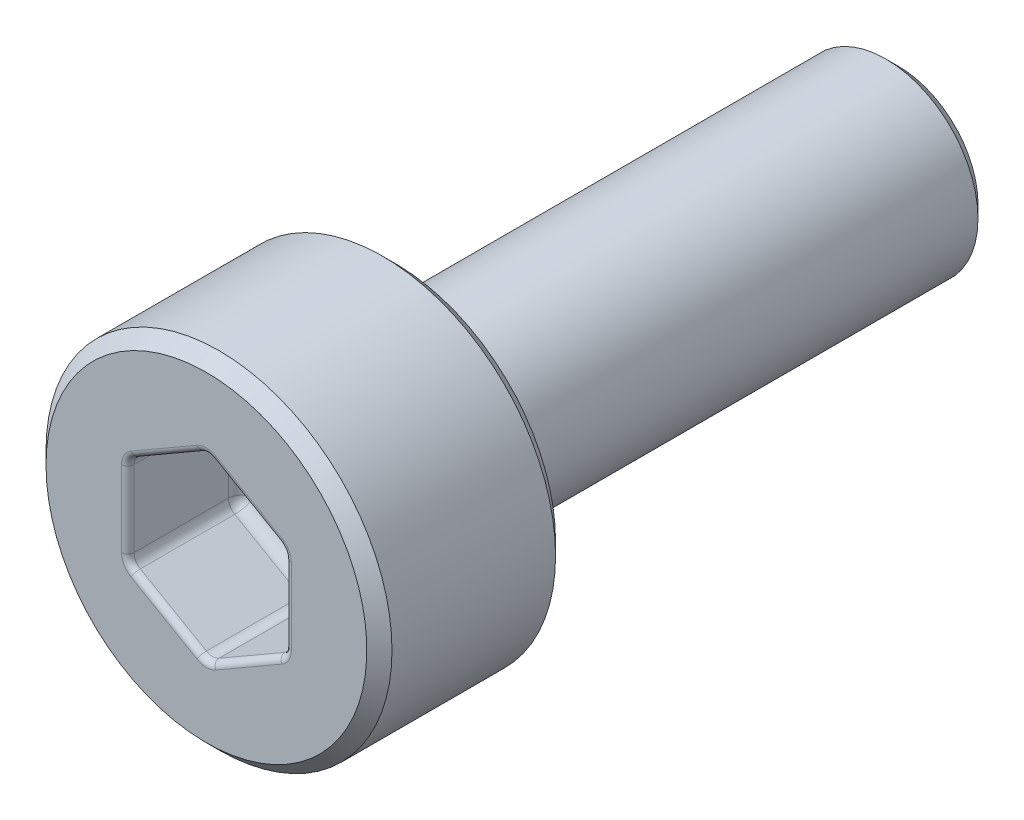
ISO-10303-21;
HEADER;
FILE_DESCRIPTION(('STEP AP214'),'2;1');
FILE_NAME('part.step','',(''),(''),'','','');
FILE_SCHEMA(('AUTOMOTIVE_DESIGN { 1 0 10303 214 1 1 1 1 }'));
ENDSEC;
DATA;
#1=APPLICATION_CONTEXT('core data for automotive mechanical design processes');
#2=APPLICATION_PROTOCOL_DEFINITION('international standard','automotive_design',2000,#1);
#3=PRODUCT_CONTEXT('',#1,'mechanical');
#4=PRODUCT('Part','Part','',(#3));
#5=PRODUCT_RELATED_PRODUCT_CATEGORY('part','',(#4));
#6=PRODUCT_DEFINITION_FORMATION('','',#4);
#7=PRODUCT_DEFINITION_CONTEXT('part definition',#1,'design');
#8=PRODUCT_DEFINITION('design','',#6,#7);
#9=PRODUCT_DEFINITION_SHAPE('','',#8);
#10=(LENGTH_UNIT() NAMED_UNIT(*) SI_UNIT(.MILLI.,.METRE.));
#11=(NAMED_UNIT(*) PLANE_ANGLE_UNIT() SI_UNIT($,.RADIAN.));
#12=(NAMED_UNIT(*) SI_UNIT($,.STERADIAN.) SOLID_ANGLE_UNIT());
#13=UNCERTAINTY_MEASURE_WITH_UNIT(LENGTH_MEASURE(1.E-05),#10,'distance_accuracy_value','');
#14=(GEOMETRIC_REPRESENTATION_CONTEXT(3) GLOBAL_UNCERTAINTY_ASSIGNED_CONTEXT((#13)) GLOBAL_UNIT_ASSIGNED_CONTEXT((#10,
#11,#12)) REPRESENTATION_CONTEXT('',''));
#15=CARTESIAN_POINT('',(0.,0.,0.));
#16=DIRECTION('',(0.,0.,1.));
#17=DIRECTION('',(1.,0.,0.));
#18=AXIS2_PLACEMENT_3D('',#15,#16,#17);
#19=CARTESIAN_POINT('',(0.,0.,3.));
#20=DIRECTION('',(0.,0.,-1.));
#21=DIRECTION('',(-1.,0.,0.));
#22=AXIS2_PLACEMENT_3D('',#19,#20,#21);
#23=PLANE('',#22);
#24=DIRECTION('',(0.,1.,0.));
#25=VECTOR('',#24,1.);
#26=CARTESIAN_POINT('',(1.35,0.,3.));
#27=LINE('',#26,#25);
#28=CARTESIAN_POINT('',(1.35,0.606217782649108,3.));
#29=VERTEX_POINT('',#28);
#30=CARTESIAN_POINT('',(1.35,-0.606217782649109,3.));
#31=VERTEX_POINT('',#30);
#32=EDGE_CURVE('E264',#29,#31,#27,.F.);
#33=ORIENTED_EDGE('',*,*,#32,.T.);
#34=CARTESIAN_POINT('',(1.05,-0.606217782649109,3.));
#35=DIRECTION('',(0.,0.,-1.));
#36=DIRECTION('',(-1.,0.,0.));
#37=AXIS2_PLACEMENT_3D('',#34,#35,#36);
#38=CIRCLE('',#37,0.3);
#39=CARTESIAN_POINT('',(1.2,-0.866025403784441,3.));
#40=VERTEX_POINT('',#39);
#41=EDGE_CURVE('E329',#31,#40,#38,.T.);
#42=ORIENTED_EDGE('',*,*,#41,.T.);
#43=DIRECTION('',(0.866025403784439,0.499999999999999,0.));
#44=VECTOR('',#43,1.);
#45=CARTESIAN_POINT('',(0.675,-1.16913429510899,3.));
#46=LINE('',#45,#44);
#47=CARTESIAN_POINT('',(0.15,-1.47224318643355,3.));
#48=VERTEX_POINT('',#47);
#49=EDGE_CURVE('E327',#40,#48,#46,.F.);
#50=ORIENTED_EDGE('',*,*,#49,.T.);
#51=CARTESIAN_POINT('',(0.,-1.21243556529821,3.));
#52=DIRECTION('',(0.,0.,-1.));
#53=DIRECTION('',(-1.,0.,0.));
#54=AXIS2_PLACEMENT_3D('',#51,#52,#53);
#55=CIRCLE('',#54,0.3);
#56=CARTESIAN_POINT('',(-0.15,-1.47224318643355,3.));
#57=VERTEX_POINT('',#56);
#58=EDGE_CURVE('E325',#48,#57,#55,.T.);
#59=ORIENTED_EDGE('',*,*,#58,.T.);
#60=DIRECTION('',(0.866025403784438,-0.500000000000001,0.));
#61=VECTOR('',#60,1.);
#62=CARTESIAN_POINT('',(-0.675000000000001,-1.16913429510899,3.));
#63=LINE('',#62,#61);
#64=CARTESIAN_POINT('',(-1.2,-0.866025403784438,3.));
#65=VERTEX_POINT('',#64);
#66=EDGE_CURVE('E323',#57,#65,#63,.F.);
#67=ORIENTED_EDGE('',*,*,#66,.T.);
#68=CARTESIAN_POINT('',(-1.05,-0.606217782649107,3.));
#69=DIRECTION('',(0.,0.,-1.));
#70=DIRECTION('',(-1.,0.,0.));
#71=AXIS2_PLACEMENT_3D('',#68,#69,#70);
#72=CIRCLE('',#71,0.3);
#73=CARTESIAN_POINT('',(-1.35,-0.606217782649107,3.));
#74=VERTEX_POINT('',#73);
#75=EDGE_CURVE('E321',#65,#74,#72,.T.);
#76=ORIENTED_EDGE('',*,*,#75,.T.);
#77=DIRECTION('',(0.,-1.,0.));
#78=VECTOR('',#77,1.);
#79=CARTESIAN_POINT('',(-1.35,0.,3.));
#80=LINE('',#79,#78);
#81=CARTESIAN_POINT('',(-1.35,0.606217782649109,3.));
#82=VERTEX_POINT('',#81);
#83=EDGE_CURVE('E319',#74,#82,#80,.F.);
#84=ORIENTED_EDGE('',*,*,#83,.T.);
#85=CARTESIAN_POINT('',(-1.05,0.606217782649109,3.));
#86=DIRECTION('',(0.,0.,-1.));
#87=DIRECTION('',(-1.,0.,0.));
#88=AXIS2_PLACEMENT_3D('',#85,#86,#87);
#89=CIRCLE('',#88,0.3);
#90=CARTESIAN_POINT('',(-1.2,0.86602540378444,3.));
#91=VERTEX_POINT('',#90);
#92=EDGE_CURVE('E317',#82,#91,#89,.T.);
#93=ORIENTED_EDGE('',*,*,#92,.T.);
#94=DIRECTION('',(-0.866025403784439,-0.5,0.));
#95=VECTOR('',#94,1.);
#96=CARTESIAN_POINT('',(-0.675,1.16913429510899,3.));
#97=LINE('',#96,#95);
#98=CARTESIAN_POINT('',(-0.149999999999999,1.47224318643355,3.));
#99=VERTEX_POINT('',#98);
#100=EDGE_CURVE('E315',#91,#99,#97,.F.);
#101=ORIENTED_EDGE('',*,*,#100,.T.);
#102=CARTESIAN_POINT('',(0.,1.21243556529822,3.));
#103=DIRECTION('',(0.,0.,-1.));
#104=DIRECTION('',(-1.,0.,0.));
#105=AXIS2_PLACEMENT_3D('',#102,#103,#104);
#106=CIRCLE('',#105,0.3);
#107=CARTESIAN_POINT('',(0.150000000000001,1.47224318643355,3.));
#108=VERTEX_POINT('',#107);
#109=EDGE_CURVE('E313',#99,#108,#106,.T.);
#110=ORIENTED_EDGE('',*,*,#109,.T.);
#111=DIRECTION('',(-0.866025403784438,0.5,0.));
#112=VECTOR('',#111,1.);
#113=CARTESIAN_POINT('',(0.675000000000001,1.16913429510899,3.));
#114=LINE('',#113,#112);
#115=CARTESIAN_POINT('',(1.2,0.86602540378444,3.));
#116=VERTEX_POINT('',#115);
#117=EDGE_CURVE('E311',#108,#116,#114,.F.);
#118=ORIENTED_EDGE('',*,*,#117,.T.);
#119=CARTESIAN_POINT('',(1.05,0.606217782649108,3.));
#120=DIRECTION('',(0.,0.,-1.));
#121=DIRECTION('',(-1.,0.,0.));
#122=AXIS2_PLACEMENT_3D('',#119,#120,#121);
#123=CIRCLE('',#122,0.3);
#124=EDGE_CURVE('E309',#116,#29,#123,.T.);
#125=ORIENTED_EDGE('',*,*,#124,.T.);
#126=EDGE_LOOP('',(#33,#42,#50,#59,#67,#76,#84,#93,#101,#110,#118,#125));
#127=FACE_BOUND('',#126,.T.);
#128=CARTESIAN_POINT('',(0.,0.,3.));
#129=DIRECTION('',(0.,0.,-1.));
#130=DIRECTION('',(-1.,0.,0.));
#131=AXIS2_PLACEMENT_3D('',#128,#129,#130);
#132=CIRCLE('',#131,2.55);
#133=CARTESIAN_POINT('',(-2.55,0.,3.));
#134=VERTEX_POINT('',#133);
#135=EDGE_CURVE('E307',#134,#134,#132,.F.);
#136=ORIENTED_EDGE('',*,*,#135,.T.);
#137=EDGE_LOOP('',(#136));
#138=FACE_BOUND('',#137,.T.);
#139=ADVANCED_FACE('F35',(#127,#138),#23,.F.);
#140=CARTESIAN_POINT('',(0.,0.,21.9198795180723));
#141=DIRECTION('',(0.,0.,1.));
#142=DIRECTION('',(1.,0.,0.));
#143=AXIS2_PLACEMENT_3D('',#140,#141,#142);
#144=CYLINDRICAL_SURFACE('',#143,2.75);
#145=CARTESIAN_POINT('',(0.,0.,2.8));
#146=DIRECTION('',(0.,0.,-1.));
#147=DIRECTION('',(-1.,0.,0.));
#148=AXIS2_PLACEMENT_3D('',#145,#146,#147);
#149=CIRCLE('',#148,2.75);
#150=CARTESIAN_POINT('',(-2.75,0.,2.8));
#151=VERTEX_POINT('',#150);
#152=EDGE_CURVE('E869',#151,#151,#149,.T.);
#153=ORIENTED_EDGE('',*,*,#152,.T.);
#154=EDGE_LOOP('',(#153));
#155=FACE_BOUND('',#154,.T.);
#156=CARTESIAN_POINT('',(0.,0.,0.199999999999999));
#157=DIRECTION('',(0.,0.,1.));
#158=DIRECTION('',(1.,0.,0.));
#159=AXIS2_PLACEMENT_3D('',#156,#157,#158);
#160=CIRCLE('',#159,2.75);
#161=CARTESIAN_POINT('',(2.75,0.,0.199999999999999));
#162=VERTEX_POINT('',#161);
#163=EDGE_CURVE('E874',#162,#162,#160,.T.);
#164=ORIENTED_EDGE('',*,*,#163,.T.);
#165=EDGE_LOOP('',(#164));
#166=FACE_BOUND('',#165,.T.);
#167=ADVANCED_FACE('F428',(#155,#166),#144,.T.);
#168=CARTESIAN_POINT('',(0.,2.75,0.));
#169=DIRECTION('',(0.,0.,1.));
#170=DIRECTION('',(1.,0.,0.));
#171=AXIS2_PLACEMENT_3D('',#168,#169,#170);
#172=PLANE('',#171);
#173=CARTESIAN_POINT('',(0.,0.,0.));
#174=DIRECTION('',(0.,0.,1.));
#175=DIRECTION('',(1.,0.,0.));
#176=AXIS2_PLACEMENT_3D('',#173,#174,#175);
#177=CIRCLE('',#176,1.665);
#178=CARTESIAN_POINT('',(1.665,0.,0.));
#179=VERTEX_POINT('',#178);
#180=EDGE_CURVE('E259',#179,#179,#177,.T.);
#181=ORIENTED_EDGE('',*,*,#180,.T.);
#182=EDGE_LOOP('',(#181));
#183=FACE_BOUND('',#182,.T.);
#184=CARTESIAN_POINT('',(0.,0.,0.));
#185=DIRECTION('',(0.,0.,1.));
#186=DIRECTION('',(1.,0.,0.));
#187=AXIS2_PLACEMENT_3D('',#184,#185,#186);
#188=CIRCLE('',#187,2.55);
#189=CARTESIAN_POINT('',(2.55,0.,0.));
#190=VERTEX_POINT('',#189);
#191=EDGE_CURVE('E867',#190,#190,#188,.F.);
#192=ORIENTED_EDGE('',*,*,#191,.T.);
#193=EDGE_LOOP('',(#192));
#194=FACE_BOUND('',#193,.T.);
#195=ADVANCED_FACE('F434',(#183,#194),#172,.F.);
#196=CARTESIAN_POINT('',(0.,0.,21.9198795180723));
#197=DIRECTION('',(0.,0.,1.));
#198=DIRECTION('',(1.,0.,0.));
#199=AXIS2_PLACEMENT_3D('',#196,#197,#198);
#200=CYLINDRICAL_SURFACE('',#199,1.465);
#201=CARTESIAN_POINT('',(0.,0.,-0.200000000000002));
#202=DIRECTION('',(0.,0.,1.));
#203=DIRECTION('',(1.,0.,0.));
#204=AXIS2_PLACEMENT_3D('',#201,#202,#203);
#205=CIRCLE('',#204,1.465);
#206=CARTESIAN_POINT('',(1.465,0.,-0.200000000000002));
#207=VERTEX_POINT('',#206);
#208=EDGE_CURVE('E262',#207,#207,#205,.F.);
#209=ORIENTED_EDGE('',*,*,#208,.T.);
#210=EDGE_LOOP('',(#209));
#211=FACE_BOUND('',#210,.T.);
#212=CARTESIAN_POINT('',(0.,0.,-7.79999999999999));
#213=DIRECTION('',(0.,0.,1.));
#214=DIRECTION('',(1.,0.,0.));
#215=AXIS2_PLACEMENT_3D('',#212,#213,#214);
#216=CIRCLE('',#215,1.465);
#217=CARTESIAN_POINT('',(1.465,0.,-7.79999999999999));
#218=VERTEX_POINT('',#217);
#219=EDGE_CURVE('E868',#218,#218,#216,.T.);
#220=ORIENTED_EDGE('',*,*,#219,.T.);
#221=EDGE_LOOP('',(#220));
#222=FACE_BOUND('',#221,.T.);
#223=ADVANCED_FACE('F809',(#211,#222),#200,.T.);
#224=CARTESIAN_POINT('',(0.,1.465,-8.));
#225=DIRECTION('',(0.,0.,1.));
#226=DIRECTION('',(1.,0.,0.));
#227=AXIS2_PLACEMENT_3D('',#224,#225,#226);
#228=PLANE('',#227);
#229=CARTESIAN_POINT('',(0.,0.,-8.));
#230=DIRECTION('',(0.,0.,1.));
#231=DIRECTION('',(1.,0.,0.));
#232=AXIS2_PLACEMENT_3D('',#229,#230,#231);
#233=CIRCLE('',#232,1.26499999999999);
#234=CARTESIAN_POINT('',(1.26499999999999,0.,-8.));
#235=VERTEX_POINT('',#234);
#236=EDGE_CURVE('E209',#235,#235,#233,.F.);
#237=ORIENTED_EDGE('',*,*,#236,.T.);
#238=EDGE_LOOP('',(#237));
#239=FACE_BOUND('',#238,.T.);
#240=ADVANCED_FACE('F801',(#239),#228,.F.);
#241=CARTESIAN_POINT('',(0.,-1.44337567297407,1.2));
#242=DIRECTION('',(0.499999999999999,-0.866025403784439,0.));
#243=DIRECTION('',(0.866025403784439,0.499999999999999,0.));
#244=AXIS2_PLACEMENT_3D('',#241,#242,#243);
#245=PLANE('',#244);
#246=DIRECTION('',(0.,0.,1.));
#247=VECTOR('',#246,1.);
#248=CARTESIAN_POINT('',(0.0999999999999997,-1.3856406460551,3.));
#249=LINE('',#248,#247);
#250=CARTESIAN_POINT('',(0.0999999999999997,-1.3856406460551,1.4));
#251=VERTEX_POINT('',#250);
#252=CARTESIAN_POINT('',(0.0999999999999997,-1.3856406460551,2.9));
#253=VERTEX_POINT('',#252);
#254=EDGE_CURVE('E256',#251,#253,#249,.T.);
#255=ORIENTED_EDGE('',*,*,#254,.T.);
#256=DIRECTION('',(0.866025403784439,0.499999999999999,0.));
#257=VECTOR('',#256,1.);
#258=CARTESIAN_POINT('',(0.,-1.44337567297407,2.9));
#259=LINE('',#258,#257);
#260=CARTESIAN_POINT('',(1.15,-0.779422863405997,2.9));
#261=VERTEX_POINT('',#260);
#262=EDGE_CURVE('E335',#253,#261,#259,.T.);
#263=ORIENTED_EDGE('',*,*,#262,.T.);
#264=DIRECTION('',(0.,0.,1.));
#265=VECTOR('',#264,1.);
#266=CARTESIAN_POINT('',(1.15,-0.779422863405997,1.2));
#267=LINE('',#266,#265);
#268=CARTESIAN_POINT('',(1.15,-0.779422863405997,1.4));
#269=VERTEX_POINT('',#268);
#270=EDGE_CURVE('E252',#261,#269,#267,.F.);
#271=ORIENTED_EDGE('',*,*,#270,.T.);
#272=DIRECTION('',(0.866025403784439,0.499999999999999,0.));
#273=VECTOR('',#272,1.);
#274=CARTESIAN_POINT('',(0.,-1.44337567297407,1.4));
#275=LINE('',#274,#273);
#276=EDGE_CURVE('E254',#269,#251,#275,.F.);
#277=ORIENTED_EDGE('',*,*,#276,.T.);
#278=EDGE_LOOP('',(#255,#263,#271,#277));
#279=FACE_BOUND('',#278,.T.);
#280=ADVANCED_FACE('F792',(#279),#245,.F.);
#281=CARTESIAN_POINT('',(-1.25,-0.721687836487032,1.2));
#282=DIRECTION('',(-0.5,-0.866025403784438,0.));
#283=DIRECTION('',(0.866025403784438,-0.500000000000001,0.));
#284=AXIS2_PLACEMENT_3D('',#281,#282,#283);
#285=PLANE('',#284);
#286=DIRECTION('',(0.,0.,1.));
#287=VECTOR('',#286,1.);
#288=CARTESIAN_POINT('',(-1.15,-0.779422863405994,3.));
#289=LINE('',#288,#287);
#290=CARTESIAN_POINT('',(-1.15,-0.779422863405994,1.4));
#291=VERTEX_POINT('',#290);
#292=CARTESIAN_POINT('',(-1.15,-0.779422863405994,2.9));
#293=VERTEX_POINT('',#292);
#294=EDGE_CURVE('E223',#291,#293,#289,.T.);
#295=ORIENTED_EDGE('',*,*,#294,.T.);
#296=DIRECTION('',(0.866025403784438,-0.500000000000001,0.));
#297=VECTOR('',#296,1.);
#298=CARTESIAN_POINT('',(-1.25,-0.721687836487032,2.9));
#299=LINE('',#298,#297);
#300=CARTESIAN_POINT('',(-0.1,-1.3856406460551,2.9));
#301=VERTEX_POINT('',#300);
#302=EDGE_CURVE('E339',#293,#301,#299,.T.);
#303=ORIENTED_EDGE('',*,*,#302,.T.);
#304=DIRECTION('',(0.,0.,1.));
#305=VECTOR('',#304,1.);
#306=CARTESIAN_POINT('',(-0.1,-1.3856406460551,1.2));
#307=LINE('',#306,#305);
#308=CARTESIAN_POINT('',(-0.1,-1.3856406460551,1.4));
#309=VERTEX_POINT('',#308);
#310=EDGE_CURVE('E215',#301,#309,#307,.F.);
#311=ORIENTED_EDGE('',*,*,#310,.T.);
#312=DIRECTION('',(0.866025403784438,-0.500000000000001,0.));
#313=VECTOR('',#312,1.);
#314=CARTESIAN_POINT('',(-1.25,-0.721687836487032,1.4));
#315=LINE('',#314,#313);
#316=EDGE_CURVE('E186',#309,#291,#315,.F.);
#317=ORIENTED_EDGE('',*,*,#316,.T.);
#318=EDGE_LOOP('',(#295,#303,#311,#317));
#319=FACE_BOUND('',#318,.T.);
#320=ADVANCED_FACE('F784',(#319),#285,.F.);
#321=CARTESIAN_POINT('',(-1.25,0.721687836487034,1.2));
#322=DIRECTION('',(-1.,0.,0.));
#323=DIRECTION('',(0.,-1.,0.));
#324=AXIS2_PLACEMENT_3D('',#321,#322,#323);
#325=PLANE('',#324);
#326=DIRECTION('',(0.,0.,1.));
#327=VECTOR('',#326,1.);
#328=CARTESIAN_POINT('',(-1.25,0.606217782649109,3.));
#329=LINE('',#328,#327);
#330=CARTESIAN_POINT('',(-1.25,0.606217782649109,1.4));
#331=VERTEX_POINT('',#330);
#332=CARTESIAN_POINT('',(-1.25,0.606217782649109,2.9));
#333=VERTEX_POINT('',#332);
#334=EDGE_CURVE('E226',#331,#333,#329,.T.);
#335=ORIENTED_EDGE('',*,*,#334,.T.);
#336=DIRECTION('',(0.,-1.,0.));
#337=VECTOR('',#336,1.);
#338=CARTESIAN_POINT('',(-1.25,0.721687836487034,2.9));
#339=LINE('',#338,#337);
#340=CARTESIAN_POINT('',(-1.25,-0.606217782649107,2.9));
#341=VERTEX_POINT('',#340);
#342=EDGE_CURVE('E343',#333,#341,#339,.T.);
#343=ORIENTED_EDGE('',*,*,#342,.T.);
#344=DIRECTION('',(0.,0.,1.));
#345=VECTOR('',#344,1.);
#346=CARTESIAN_POINT('',(-1.25,-0.606217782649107,1.2));
#347=LINE('',#346,#345);
#348=CARTESIAN_POINT('',(-1.25,-0.606217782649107,1.4));
#349=VERTEX_POINT('',#348);
#350=EDGE_CURVE('E231',#341,#349,#347,.F.);
#351=ORIENTED_EDGE('',*,*,#350,.T.);
#352=DIRECTION('',(0.,-1.,0.));
#353=VECTOR('',#352,1.);
#354=CARTESIAN_POINT('',(-1.25,0.721687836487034,1.4));
#355=LINE('',#354,#353);
#356=EDGE_CURVE('E229',#349,#331,#355,.F.);
#357=ORIENTED_EDGE('',*,*,#356,.T.);
#358=EDGE_LOOP('',(#335,#343,#351,#357));
#359=FACE_BOUND('',#358,.T.);
#360=ADVANCED_FACE('F403',(#359),#325,.F.);
#361=CARTESIAN_POINT('',(0.,1.44337567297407,1.2));
#362=DIRECTION('',(-0.5,0.866025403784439,0.));
#363=DIRECTION('',(-0.866025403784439,-0.5,0.));
#364=AXIS2_PLACEMENT_3D('',#361,#362,#363);
#365=PLANE('',#364);
#366=DIRECTION('',(0.,0.,1.));
#367=VECTOR('',#366,1.);
#368=CARTESIAN_POINT('',(-0.0999999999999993,1.3856406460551,3.));
#369=LINE('',#368,#367);
#370=CARTESIAN_POINT('',(-0.0999999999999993,1.3856406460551,1.4));
#371=VERTEX_POINT('',#370);
#372=CARTESIAN_POINT('',(-0.0999999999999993,1.3856406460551,2.9));
#373=VERTEX_POINT('',#372);
#374=EDGE_CURVE('E237',#371,#373,#369,.T.);
#375=ORIENTED_EDGE('',*,*,#374,.T.);
#376=DIRECTION('',(-0.866025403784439,-0.5,0.));
#377=VECTOR('',#376,1.);
#378=CARTESIAN_POINT('',(0.,1.44337567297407,2.9));
#379=LINE('',#378,#377);
#380=CARTESIAN_POINT('',(-1.15,0.779422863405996,2.9));
#381=VERTEX_POINT('',#380);
#382=EDGE_CURVE('E347',#373,#381,#379,.T.);
#383=ORIENTED_EDGE('',*,*,#382,.T.);
#384=DIRECTION('',(0.,0.,1.));
#385=VECTOR('',#384,1.);
#386=CARTESIAN_POINT('',(-1.15,0.779422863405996,1.2));
#387=LINE('',#386,#385);
#388=CARTESIAN_POINT('',(-1.15,0.779422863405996,1.4));
#389=VERTEX_POINT('',#388);
#390=EDGE_CURVE('E233',#381,#389,#387,.F.);
#391=ORIENTED_EDGE('',*,*,#390,.T.);
#392=DIRECTION('',(-0.866025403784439,-0.5,0.));
#393=VECTOR('',#392,1.);
#394=CARTESIAN_POINT('',(0.,1.44337567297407,1.4));
#395=LINE('',#394,#393);
#396=EDGE_CURVE('E235',#389,#371,#395,.F.);
#397=ORIENTED_EDGE('',*,*,#396,.T.);
#398=EDGE_LOOP('',(#375,#383,#391,#397));
#399=FACE_BOUND('',#398,.T.);
#400=ADVANCED_FACE('F767',(#399),#365,.F.);
#401=CARTESIAN_POINT('',(1.25,0.721687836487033,1.2));
#402=DIRECTION('',(0.5,0.866025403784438,0.));
#403=DIRECTION('',(-0.866025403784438,0.5,0.));
#404=AXIS2_PLACEMENT_3D('',#401,#402,#403);
#405=PLANE('',#404);
#406=DIRECTION('',(0.,0.,1.));
#407=VECTOR('',#406,1.);
#408=CARTESIAN_POINT('',(1.15,0.779422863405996,3.));
#409=LINE('',#408,#407);
#410=CARTESIAN_POINT('',(1.15,0.779422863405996,1.4));
#411=VERTEX_POINT('',#410);
#412=CARTESIAN_POINT('',(1.15,0.779422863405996,2.9));
#413=VERTEX_POINT('',#412);
#414=EDGE_CURVE('E244',#411,#413,#409,.T.);
#415=ORIENTED_EDGE('',*,*,#414,.T.);
#416=DIRECTION('',(-0.866025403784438,0.5,0.));
#417=VECTOR('',#416,1.);
#418=CARTESIAN_POINT('',(1.25,0.721687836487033,2.9));
#419=LINE('',#418,#417);
#420=CARTESIAN_POINT('',(0.100000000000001,1.3856406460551,2.9));
#421=VERTEX_POINT('',#420);
#422=EDGE_CURVE('E351',#413,#421,#419,.T.);
#423=ORIENTED_EDGE('',*,*,#422,.T.);
#424=DIRECTION('',(0.,0.,1.));
#425=VECTOR('',#424,1.);
#426=CARTESIAN_POINT('',(0.100000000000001,1.3856406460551,1.2));
#427=LINE('',#426,#425);
#428=CARTESIAN_POINT('',(0.100000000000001,1.3856406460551,1.4));
#429=VERTEX_POINT('',#428);
#430=EDGE_CURVE('E240',#421,#429,#427,.F.);
#431=ORIENTED_EDGE('',*,*,#430,.T.);
#432=DIRECTION('',(-0.866025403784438,0.5,0.));
#433=VECTOR('',#432,1.);
#434=CARTESIAN_POINT('',(1.25,0.721687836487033,1.4));
#435=LINE('',#434,#433);
#436=EDGE_CURVE('E242',#429,#411,#435,.F.);
#437=ORIENTED_EDGE('',*,*,#436,.T.);
#438=EDGE_LOOP('',(#415,#423,#431,#437));
#439=FACE_BOUND('',#438,.T.);
#440=ADVANCED_FACE('F759',(#439),#405,.F.);
#441=CARTESIAN_POINT('',(1.25,-0.721687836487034,1.2));
#442=DIRECTION('',(1.,0.,0.));
#443=DIRECTION('',(0.,1.,0.));
#444=AXIS2_PLACEMENT_3D('',#441,#442,#443);
#445=PLANE('',#444);
#446=DIRECTION('',(0.,0.,1.));
#447=VECTOR('',#446,1.);
#448=CARTESIAN_POINT('',(1.25,-0.606217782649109,3.));
#449=LINE('',#448,#447);
#450=CARTESIAN_POINT('',(1.25,-0.606217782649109,1.4));
#451=VERTEX_POINT('',#450);
#452=CARTESIAN_POINT('',(1.25,-0.606217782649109,2.9));
#453=VERTEX_POINT('',#452);
#454=EDGE_CURVE('E250',#451,#453,#449,.T.);
#455=ORIENTED_EDGE('',*,*,#454,.T.);
#456=DIRECTION('',(0.,1.,0.));
#457=VECTOR('',#456,1.);
#458=CARTESIAN_POINT('',(1.25,-0.721687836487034,2.9));
#459=LINE('',#458,#457);
#460=CARTESIAN_POINT('',(1.25,0.606217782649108,2.9));
#461=VERTEX_POINT('',#460);
#462=EDGE_CURVE('E11',#453,#461,#459,.T.);
#463=ORIENTED_EDGE('',*,*,#462,.T.);
#464=DIRECTION('',(0.,0.,1.));
#465=VECTOR('',#464,1.);
#466=CARTESIAN_POINT('',(1.25,0.606217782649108,1.2));
#467=LINE('',#466,#465);
#468=CARTESIAN_POINT('',(1.25,0.606217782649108,1.4));
#469=VERTEX_POINT('',#468);
#470=EDGE_CURVE('E246',#461,#469,#467,.F.);
#471=ORIENTED_EDGE('',*,*,#470,.T.);
#472=DIRECTION('',(0.,1.,0.));
#473=VECTOR('',#472,1.);
#474=CARTESIAN_POINT('',(1.25,-0.721687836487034,1.4));
#475=LINE('',#474,#473);
#476=EDGE_CURVE('E248',#469,#451,#475,.F.);
#477=ORIENTED_EDGE('',*,*,#476,.T.);
#478=EDGE_LOOP('',(#455,#463,#471,#477));
#479=FACE_BOUND('',#478,.T.);
#480=ADVANCED_FACE('F751',(#479),#445,.F.);
#481=CARTESIAN_POINT('',(0.,0.,1.2));
#482=DIRECTION('',(0.,0.,1.));
#483=DIRECTION('',(1.,0.,0.));
#484=AXIS2_PLACEMENT_3D('',#481,#482,#483);
#485=PLANE('',#484);
#486=DIRECTION('',(0.,-1.,0.));
#487=VECTOR('',#486,1.);
#488=CARTESIAN_POINT('',(-1.05,0.,1.2));
#489=LINE('',#488,#487);
#490=CARTESIAN_POINT('',(-1.05,0.606217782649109,1.2));
#491=VERTEX_POINT('',#490);
#492=CARTESIAN_POINT('',(-1.05,-0.606217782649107,1.2));
#493=VERTEX_POINT('',#492);
#494=EDGE_CURVE('E213',#491,#493,#489,.T.);
#495=ORIENTED_EDGE('',*,*,#494,.T.);
#496=DIRECTION('',(0.866025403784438,-0.500000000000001,0.));
#497=VECTOR('',#496,1.);
#498=CARTESIAN_POINT('',(-0.525000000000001,-0.909326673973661,1.2));
#499=LINE('',#498,#497);
#500=CARTESIAN_POINT('',(0.,-1.21243556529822,1.2));
#501=VERTEX_POINT('',#500);
#502=EDGE_CURVE('E184',#493,#501,#499,.T.);
#503=ORIENTED_EDGE('',*,*,#502,.T.);
#504=DIRECTION('',(0.866025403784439,0.499999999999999,0.));
#505=VECTOR('',#504,1.);
#506=CARTESIAN_POINT('',(0.525,-0.909326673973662,1.2));
#507=LINE('',#506,#505);
#508=CARTESIAN_POINT('',(1.05,-0.606217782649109,1.2));
#509=VERTEX_POINT('',#508);
#510=EDGE_CURVE('E202',#501,#509,#507,.T.);
#511=ORIENTED_EDGE('',*,*,#510,.T.);
#512=DIRECTION('',(0.,1.,0.));
#513=VECTOR('',#512,1.);
#514=CARTESIAN_POINT('',(1.05,0.,1.2));
#515=LINE('',#514,#513);
#516=CARTESIAN_POINT('',(1.05,0.606217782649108,1.2));
#517=VERTEX_POINT('',#516);
#518=EDGE_CURVE('E208',#509,#517,#515,.T.);
#519=ORIENTED_EDGE('',*,*,#518,.T.);
#520=DIRECTION('',(-0.866025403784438,0.5,0.));
#521=VECTOR('',#520,1.);
#522=CARTESIAN_POINT('',(0.525000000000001,0.909326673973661,1.2));
#523=LINE('',#522,#521);
#524=CARTESIAN_POINT('',(0.,1.21243556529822,1.2));
#525=VERTEX_POINT('',#524);
#526=EDGE_CURVE('E881',#517,#525,#523,.T.);
#527=ORIENTED_EDGE('',*,*,#526,.T.);
#528=DIRECTION('',(-0.866025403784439,-0.5,0.));
#529=VECTOR('',#528,1.);
#530=CARTESIAN_POINT('',(-0.525,0.909326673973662,1.2));
#531=LINE('',#530,#529);
#532=EDGE_CURVE('E218',#525,#491,#531,.T.);
#533=ORIENTED_EDGE('',*,*,#532,.T.);
#534=EDGE_LOOP('',(#495,#503,#511,#519,#527,#533));
#535=FACE_BOUND('',#534,.T.);
#536=ADVANCED_FACE('F211',(#535),#485,.T.);
#537=CARTESIAN_POINT('',(0.,0.,3.));
#538=DIRECTION('',(0.,0.,-1.));
#539=DIRECTION('',(-1.,0.,0.));
#540=AXIS2_PLACEMENT_3D('',#537,#538,#539);
#541=CONICAL_SURFACE('',#540,2.55,0.785398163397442);
#542=ORIENTED_EDGE('',*,*,#152,.F.);
#543=EDGE_LOOP('',(#542));
#544=FACE_BOUND('',#543,.T.);
#545=ORIENTED_EDGE('',*,*,#135,.F.);
#546=EDGE_LOOP('',(#545));
#547=FACE_BOUND('',#546,.T.);
#548=ADVANCED_FACE('F440',(#544,#547),#541,.T.);
#549=CARTESIAN_POINT('',(0.,0.,0.199999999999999));
#550=DIRECTION('',(0.,0.,1.));
#551=DIRECTION('',(1.,0.,0.));
#552=AXIS2_PLACEMENT_3D('',#549,#550,#551);
#553=CONICAL_SURFACE('',#552,2.75,0.785398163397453);
#554=ORIENTED_EDGE('',*,*,#191,.F.);
#555=EDGE_LOOP('',(#554));
#556=FACE_BOUND('',#555,.T.);
#557=ORIENTED_EDGE('',*,*,#163,.F.);
#558=EDGE_LOOP('',(#557));
#559=FACE_BOUND('',#558,.T.);
#560=ADVANCED_FACE('F443',(#556,#559),#553,.T.);
#561=CARTESIAN_POINT('',(0.,0.,-7.79999999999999));
#562=DIRECTION('',(0.,0.,1.));
#563=DIRECTION('',(1.,0.,0.));
#564=AXIS2_PLACEMENT_3D('',#561,#562,#563);
#565=CONICAL_SURFACE('',#564,1.465,0.78539816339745);
#566=ORIENTED_EDGE('',*,*,#236,.F.);
#567=EDGE_LOOP('',(#566));
#568=FACE_BOUND('',#567,.T.);
#569=ORIENTED_EDGE('',*,*,#219,.F.);
#570=EDGE_LOOP('',(#569));
#571=FACE_BOUND('',#570,.T.);
#572=ADVANCED_FACE('F447',(#568,#571),#565,.T.);
#573=CARTESIAN_POINT('',(0.,1.21243556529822,1.2));
#574=DIRECTION('',(0.,0.,-1.));
#575=DIRECTION('',(-1.,0.,0.));
#576=AXIS2_PLACEMENT_3D('',#573,#574,#575);
#577=CYLINDRICAL_SURFACE('',#576,0.2);
#578=ORIENTED_EDGE('',*,*,#430,.F.);
#579=CARTESIAN_POINT('',(0.,1.21243556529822,2.9));
#580=DIRECTION('',(0.,0.,-1.));
#581=DIRECTION('',(-1.,0.,0.));
#582=AXIS2_PLACEMENT_3D('',#579,#580,#581);
#583=CIRCLE('',#582,0.2);
#584=EDGE_CURVE('E349',#421,#373,#583,.F.);
#585=ORIENTED_EDGE('',*,*,#584,.T.);
#586=ORIENTED_EDGE('',*,*,#374,.F.);
#587=CARTESIAN_POINT('',(0.,1.21243556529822,1.4));
#588=DIRECTION('',(0.,0.,1.));
#589=DIRECTION('',(1.,0.,0.));
#590=AXIS2_PLACEMENT_3D('',#587,#588,#589);
#591=CIRCLE('',#590,0.2);
#592=EDGE_CURVE('E304',#429,#371,#591,.T.);
#593=ORIENTED_EDGE('',*,*,#592,.F.);
#594=EDGE_LOOP('',(#578,#585,#586,#593));
#595=FACE_BOUND('',#594,.T.);
#596=ADVANCED_FACE('F451',(#595),#577,.F.);
#597=CARTESIAN_POINT('',(0.525000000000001,0.909326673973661,1.4));
#598=DIRECTION('',(-0.866025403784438,0.5,0.));
#599=DIRECTION('',(-0.5,-0.866025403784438,0.));
#600=AXIS2_PLACEMENT_3D('',#597,#598,#599);
#601=CYLINDRICAL_SURFACE('',#600,0.2);
#602=CARTESIAN_POINT('',(1.05,0.606217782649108,1.4));
#603=DIRECTION('',(-0.866025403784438,0.5,0.));
#604=DIRECTION('',(-0.5,-0.866025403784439,0.));
#605=AXIS2_PLACEMENT_3D('',#602,#603,#604);
#606=CIRCLE('',#605,0.2);
#607=EDGE_CURVE('E298',#411,#517,#606,.T.);
#608=ORIENTED_EDGE('',*,*,#607,.F.);
#609=ORIENTED_EDGE('',*,*,#436,.F.);
#610=CARTESIAN_POINT('',(0.,1.21243556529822,1.4));
#611=DIRECTION('',(0.866025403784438,-0.500000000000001,0.));
#612=DIRECTION('',(0.500000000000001,0.866025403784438,0.));
#613=AXIS2_PLACEMENT_3D('',#610,#611,#612);
#614=CIRCLE('',#613,0.2);
#615=EDGE_CURVE('E301',#525,#429,#614,.T.);
#616=ORIENTED_EDGE('',*,*,#615,.F.);
#617=ORIENTED_EDGE('',*,*,#526,.F.);
#618=EDGE_LOOP('',(#608,#609,#616,#617));
#619=FACE_BOUND('',#618,.T.);
#620=ADVANCED_FACE('F712',(#619),#601,.F.);
#621=CARTESIAN_POINT('',(1.05,0.606217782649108,1.2));
#622=DIRECTION('',(0.,0.,-1.));
#623=DIRECTION('',(-1.,0.,0.));
#624=AXIS2_PLACEMENT_3D('',#621,#622,#623);
#625=CYLINDRICAL_SURFACE('',#624,0.2);
#626=ORIENTED_EDGE('',*,*,#470,.F.);
#627=CARTESIAN_POINT('',(1.05,0.606217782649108,2.9));
#628=DIRECTION('',(0.,0.,-1.));
#629=DIRECTION('',(-1.,0.,0.));
#630=AXIS2_PLACEMENT_3D('',#627,#628,#629);
#631=CIRCLE('',#630,0.2);
#632=EDGE_CURVE('E44',#461,#413,#631,.F.);
#633=ORIENTED_EDGE('',*,*,#632,.T.);
#634=ORIENTED_EDGE('',*,*,#414,.F.);
#635=CARTESIAN_POINT('',(1.05,0.606217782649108,1.4));
#636=DIRECTION('',(0.,0.,1.));
#637=DIRECTION('',(1.,0.,0.));
#638=AXIS2_PLACEMENT_3D('',#635,#636,#637);
#639=CIRCLE('',#638,0.2);
#640=EDGE_CURVE('E295',#469,#411,#639,.T.);
#641=ORIENTED_EDGE('',*,*,#640,.F.);
#642=EDGE_LOOP('',(#626,#633,#634,#641));
#643=FACE_BOUND('',#642,.T.);
#644=ADVANCED_FACE('F703',(#643),#625,.F.);
#645=CARTESIAN_POINT('',(0.,1.21243556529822,1.4));
#646=DIRECTION('',(0.,0.,1.));
#647=DIRECTION('',(1.,0.,0.));
#648=AXIS2_PLACEMENT_3D('',#645,#646,#647);
#649=SPHERICAL_SURFACE('',#648,0.2);
#650=ORIENTED_EDGE('',*,*,#615,.T.);
#651=ORIENTED_EDGE('',*,*,#592,.T.);
#652=CARTESIAN_POINT('',(0.,1.21243556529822,1.4));
#653=DIRECTION('',(-0.866025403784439,-0.5,0.));
#654=DIRECTION('',(0.5,-0.866025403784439,0.));
#655=AXIS2_PLACEMENT_3D('',#652,#653,#654);
#656=CIRCLE('',#655,0.2);
#657=EDGE_CURVE('E292',#525,#371,#656,.F.);
#658=ORIENTED_EDGE('',*,*,#657,.F.);
#659=EDGE_LOOP('',(#650,#651,#658));
#660=FACE_BOUND('',#659,.T.);
#661=ADVANCED_FACE('F694',(#660),#649,.F.);
#662=CARTESIAN_POINT('',(1.05,0.606217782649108,1.4));
#663=DIRECTION('',(0.,0.,1.));
#664=DIRECTION('',(1.,0.,0.));
#665=AXIS2_PLACEMENT_3D('',#662,#663,#664);
#666=SPHERICAL_SURFACE('',#665,0.2);
#667=ORIENTED_EDGE('',*,*,#640,.T.);
#668=ORIENTED_EDGE('',*,*,#607,.T.);
#669=CARTESIAN_POINT('',(1.05,0.606217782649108,1.4));
#670=DIRECTION('',(0.,-1.,0.));
#671=DIRECTION('',(0.,0.,-1.));
#672=AXIS2_PLACEMENT_3D('',#669,#670,#671);
#673=CIRCLE('',#672,0.2);
#674=EDGE_CURVE('E289',#469,#517,#673,.F.);
#675=ORIENTED_EDGE('',*,*,#674,.F.);
#676=EDGE_LOOP('',(#667,#668,#675));
#677=FACE_BOUND('',#676,.T.);
#678=ADVANCED_FACE('F686',(#677),#666,.F.);
#679=CARTESIAN_POINT('',(-1.05,0.606217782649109,1.2));
#680=DIRECTION('',(0.,0.,-1.));
#681=DIRECTION('',(-1.,0.,0.));
#682=AXIS2_PLACEMENT_3D('',#679,#680,#681);
#683=CYLINDRICAL_SURFACE('',#682,0.2);
#684=ORIENTED_EDGE('',*,*,#390,.F.);
#685=CARTESIAN_POINT('',(-1.05,0.606217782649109,2.9));
#686=DIRECTION('',(0.,0.,-1.));
#687=DIRECTION('',(-1.,0.,0.));
#688=AXIS2_PLACEMENT_3D('',#685,#686,#687);
#689=CIRCLE('',#688,0.2);
#690=EDGE_CURVE('E345',#381,#333,#689,.F.);
#691=ORIENTED_EDGE('',*,*,#690,.T.);
#692=ORIENTED_EDGE('',*,*,#334,.F.);
#693=CARTESIAN_POINT('',(-1.05,0.606217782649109,1.4));
#694=DIRECTION('',(0.,0.,1.));
#695=DIRECTION('',(1.,0.,0.));
#696=AXIS2_PLACEMENT_3D('',#693,#694,#695);
#697=CIRCLE('',#696,0.2);
#698=EDGE_CURVE('E286',#389,#331,#697,.T.);
#699=ORIENTED_EDGE('',*,*,#698,.F.);
#700=EDGE_LOOP('',(#684,#691,#692,#699));
#701=FACE_BOUND('',#700,.T.);
#702=ADVANCED_FACE('F400',(#701),#683,.F.);
#703=CARTESIAN_POINT('',(-0.525,0.909326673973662,1.4));
#704=DIRECTION('',(-0.866025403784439,-0.5,0.));
#705=DIRECTION('',(0.5,-0.866025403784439,0.));
#706=AXIS2_PLACEMENT_3D('',#703,#704,#705);
#707=CYLINDRICAL_SURFACE('',#706,0.2);
#708=ORIENTED_EDGE('',*,*,#657,.T.);
#709=ORIENTED_EDGE('',*,*,#396,.F.);
#710=CARTESIAN_POINT('',(-1.05,0.606217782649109,1.4));
#711=DIRECTION('',(0.866025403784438,0.5,0.));
#712=DIRECTION('',(-0.5,0.866025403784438,0.));
#713=AXIS2_PLACEMENT_3D('',#710,#711,#712);
#714=CIRCLE('',#713,0.2);
#715=EDGE_CURVE('E283',#491,#389,#714,.T.);
#716=ORIENTED_EDGE('',*,*,#715,.F.);
#717=ORIENTED_EDGE('',*,*,#532,.F.);
#718=EDGE_LOOP('',(#708,#709,#716,#717));
#719=FACE_BOUND('',#718,.T.);
#720=ADVANCED_FACE('F669',(#719),#707,.F.);
#721=CARTESIAN_POINT('',(1.05,0.,1.4));
#722=DIRECTION('',(0.,1.,0.));
#723=DIRECTION('',(-1.,0.,0.));
#724=AXIS2_PLACEMENT_3D('',#721,#722,#723);
#725=CYLINDRICAL_SURFACE('',#724,0.2);
#726=ORIENTED_EDGE('',*,*,#674,.T.);
#727=ORIENTED_EDGE('',*,*,#518,.F.);
#728=CARTESIAN_POINT('',(1.05,-0.606217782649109,1.4));
#729=DIRECTION('',(0.,1.,0.));
#730=DIRECTION('',(0.,0.,1.));
#731=AXIS2_PLACEMENT_3D('',#728,#729,#730);
#732=CIRCLE('',#731,0.2);
#733=EDGE_CURVE('E280',#451,#509,#732,.T.);
#734=ORIENTED_EDGE('',*,*,#733,.F.);
#735=ORIENTED_EDGE('',*,*,#476,.F.);
#736=EDGE_LOOP('',(#726,#727,#734,#735));
#737=FACE_BOUND('',#736,.T.);
#738=ADVANCED_FACE('F660',(#737),#725,.F.);
#739=CARTESIAN_POINT('',(1.05,-0.606217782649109,1.2));
#740=DIRECTION('',(0.,0.,-1.));
#741=DIRECTION('',(-1.,0.,0.));
#742=AXIS2_PLACEMENT_3D('',#739,#740,#741);
#743=CYLINDRICAL_SURFACE('',#742,0.2);
#744=ORIENTED_EDGE('',*,*,#270,.F.);
#745=CARTESIAN_POINT('',(1.05,-0.606217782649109,2.9));
#746=DIRECTION('',(0.,0.,-1.));
#747=DIRECTION('',(-1.,0.,0.));
#748=AXIS2_PLACEMENT_3D('',#745,#746,#747);
#749=CIRCLE('',#748,0.2);
#750=EDGE_CURVE('E332',#261,#453,#749,.F.);
#751=ORIENTED_EDGE('',*,*,#750,.T.);
#752=ORIENTED_EDGE('',*,*,#454,.F.);
#753=CARTESIAN_POINT('',(1.05,-0.606217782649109,1.4));
#754=DIRECTION('',(0.,0.,1.));
#755=DIRECTION('',(1.,0.,0.));
#756=AXIS2_PLACEMENT_3D('',#753,#754,#755);
#757=CIRCLE('',#756,0.2);
#758=EDGE_CURVE('E277',#269,#451,#757,.T.);
#759=ORIENTED_EDGE('',*,*,#758,.F.);
#760=EDGE_LOOP('',(#744,#751,#752,#759));
#761=FACE_BOUND('',#760,.T.);
#762=ADVANCED_FACE('F651',(#761),#743,.F.);
#763=CARTESIAN_POINT('',(-1.05,0.606217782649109,1.4));
#764=DIRECTION('',(0.,0.,1.));
#765=DIRECTION('',(1.,0.,0.));
#766=AXIS2_PLACEMENT_3D('',#763,#764,#765);
#767=SPHERICAL_SURFACE('',#766,0.2);
#768=ORIENTED_EDGE('',*,*,#715,.T.);
#769=ORIENTED_EDGE('',*,*,#698,.T.);
#770=CARTESIAN_POINT('',(-1.05,0.606217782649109,1.4));
#771=DIRECTION('',(0.,-1.,0.));
#772=DIRECTION('',(0.,0.,-1.));
#773=AXIS2_PLACEMENT_3D('',#770,#771,#772);
#774=CIRCLE('',#773,0.2);
#775=EDGE_CURVE('E274',#491,#331,#774,.F.);
#776=ORIENTED_EDGE('',*,*,#775,.F.);
#777=EDGE_LOOP('',(#768,#769,#776));
#778=FACE_BOUND('',#777,.T.);
#779=ADVANCED_FACE('F642',(#778),#767,.F.);
#780=CARTESIAN_POINT('',(1.05,-0.606217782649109,1.4));
#781=DIRECTION('',(0.,0.,1.));
#782=DIRECTION('',(1.,0.,0.));
#783=AXIS2_PLACEMENT_3D('',#780,#781,#782);
#784=SPHERICAL_SURFACE('',#783,0.2);
#785=ORIENTED_EDGE('',*,*,#758,.T.);
#786=ORIENTED_EDGE('',*,*,#733,.T.);
#787=CARTESIAN_POINT('',(1.05,-0.606217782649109,1.4));
#788=DIRECTION('',(-0.866025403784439,-0.5,0.));
#789=DIRECTION('',(0.5,-0.866025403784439,0.));
#790=AXIS2_PLACEMENT_3D('',#787,#788,#789);
#791=CIRCLE('',#790,0.2);
#792=EDGE_CURVE('E205',#269,#509,#791,.F.);
#793=ORIENTED_EDGE('',*,*,#792,.F.);
#794=EDGE_LOOP('',(#785,#786,#793));
#795=FACE_BOUND('',#794,.T.);
#796=ADVANCED_FACE('F634',(#795),#784,.F.);
#797=CARTESIAN_POINT('',(-1.05,-0.606217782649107,1.2));
#798=DIRECTION('',(0.,0.,-1.));
#799=DIRECTION('',(-1.,0.,0.));
#800=AXIS2_PLACEMENT_3D('',#797,#798,#799);
#801=CYLINDRICAL_SURFACE('',#800,0.2);
#802=ORIENTED_EDGE('',*,*,#350,.F.);
#803=CARTESIAN_POINT('',(-1.05,-0.606217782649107,2.9));
#804=DIRECTION('',(0.,0.,-1.));
#805=DIRECTION('',(-1.,0.,0.));
#806=AXIS2_PLACEMENT_3D('',#803,#804,#805);
#807=CIRCLE('',#806,0.2);
#808=EDGE_CURVE('E341',#341,#293,#807,.F.);
#809=ORIENTED_EDGE('',*,*,#808,.T.);
#810=ORIENTED_EDGE('',*,*,#294,.F.);
#811=CARTESIAN_POINT('',(-1.05,-0.606217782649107,1.4));
#812=DIRECTION('',(0.,0.,1.));
#813=DIRECTION('',(1.,0.,0.));
#814=AXIS2_PLACEMENT_3D('',#811,#812,#813);
#815=CIRCLE('',#814,0.2);
#816=EDGE_CURVE('E270',#349,#291,#815,.T.);
#817=ORIENTED_EDGE('',*,*,#816,.F.);
#818=EDGE_LOOP('',(#802,#809,#810,#817));
#819=FACE_BOUND('',#818,.T.);
#820=ADVANCED_FACE('F413',(#819),#801,.F.);
#821=CARTESIAN_POINT('',(-1.05,0.,1.4));
#822=DIRECTION('',(0.,-1.,0.));
#823=DIRECTION('',(1.,0.,0.));
#824=AXIS2_PLACEMENT_3D('',#821,#822,#823);
#825=CYLINDRICAL_SURFACE('',#824,0.2);
#826=ORIENTED_EDGE('',*,*,#775,.T.);
#827=ORIENTED_EDGE('',*,*,#356,.F.);
#828=CARTESIAN_POINT('',(-1.05,-0.606217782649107,1.4));
#829=DIRECTION('',(0.,1.,0.));
#830=DIRECTION('',(-1.,0.,0.));
#831=AXIS2_PLACEMENT_3D('',#828,#829,#830);
#832=CIRCLE('',#831,0.2);
#833=EDGE_CURVE('E199',#493,#349,#832,.T.);
#834=ORIENTED_EDGE('',*,*,#833,.F.);
#835=ORIENTED_EDGE('',*,*,#494,.F.);
#836=EDGE_LOOP('',(#826,#827,#834,#835));
#837=FACE_BOUND('',#836,.T.);
#838=ADVANCED_FACE('F408',(#837),#825,.F.);
#839=CARTESIAN_POINT('',(0.525,-0.909326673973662,1.4));
#840=DIRECTION('',(0.866025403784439,0.499999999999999,0.));
#841=DIRECTION('',(-0.499999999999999,0.866025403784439,0.));
#842=AXIS2_PLACEMENT_3D('',#839,#840,#841);
#843=CYLINDRICAL_SURFACE('',#842,0.2);
#844=ORIENTED_EDGE('',*,*,#792,.T.);
#845=ORIENTED_EDGE('',*,*,#510,.F.);
#846=CARTESIAN_POINT('',(0.,-1.21243556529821,1.4));
#847=DIRECTION('',(0.866025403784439,0.499999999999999,0.));
#848=DIRECTION('',(-0.499999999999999,0.866025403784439,0.));
#849=AXIS2_PLACEMENT_3D('',#846,#847,#848);
#850=CIRCLE('',#849,0.2);
#851=EDGE_CURVE('E192',#251,#501,#850,.T.);
#852=ORIENTED_EDGE('',*,*,#851,.F.);
#853=ORIENTED_EDGE('',*,*,#276,.F.);
#854=EDGE_LOOP('',(#844,#845,#852,#853));
#855=FACE_BOUND('',#854,.T.);
#856=ADVANCED_FACE('F203',(#855),#843,.F.);
#857=CARTESIAN_POINT('',(0.,-1.21243556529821,1.2));
#858=DIRECTION('',(0.,0.,-1.));
#859=DIRECTION('',(-1.,0.,0.));
#860=AXIS2_PLACEMENT_3D('',#857,#858,#859);
#861=CYLINDRICAL_SURFACE('',#860,0.2);
#862=ORIENTED_EDGE('',*,*,#310,.F.);
#863=CARTESIAN_POINT('',(0.,-1.21243556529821,2.9));
#864=DIRECTION('',(0.,0.,-1.));
#865=DIRECTION('',(-1.,0.,0.));
#866=AXIS2_PLACEMENT_3D('',#863,#864,#865);
#867=CIRCLE('',#866,0.2);
#868=EDGE_CURVE('E337',#301,#253,#867,.F.);
#869=ORIENTED_EDGE('',*,*,#868,.T.);
#870=ORIENTED_EDGE('',*,*,#254,.F.);
#871=CARTESIAN_POINT('',(0.,-1.21243556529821,1.4));
#872=DIRECTION('',(0.,0.,1.));
#873=DIRECTION('',(1.,0.,0.));
#874=AXIS2_PLACEMENT_3D('',#871,#872,#873);
#875=CIRCLE('',#874,0.2);
#876=EDGE_CURVE('E196',#309,#251,#875,.T.);
#877=ORIENTED_EDGE('',*,*,#876,.F.);
#878=EDGE_LOOP('',(#862,#869,#870,#877));
#879=FACE_BOUND('',#878,.T.);
#880=ADVANCED_FACE('F418',(#879),#861,.F.);
#881=CARTESIAN_POINT('',(-1.05,-0.606217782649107,1.4));
#882=DIRECTION('',(0.,0.,1.));
#883=DIRECTION('',(1.,0.,0.));
#884=AXIS2_PLACEMENT_3D('',#881,#882,#883);
#885=SPHERICAL_SURFACE('',#884,0.2);
#886=ORIENTED_EDGE('',*,*,#833,.T.);
#887=ORIENTED_EDGE('',*,*,#816,.T.);
#888=CARTESIAN_POINT('',(-1.05,-0.606217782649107,1.4));
#889=DIRECTION('',(0.866025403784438,-0.5,0.));
#890=DIRECTION('',(0.5,0.866025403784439,0.));
#891=AXIS2_PLACEMENT_3D('',#888,#889,#890);
#892=CIRCLE('',#891,0.2);
#893=EDGE_CURVE('E189',#493,#291,#892,.F.);
#894=ORIENTED_EDGE('',*,*,#893,.F.);
#895=EDGE_LOOP('',(#886,#887,#894));
#896=FACE_BOUND('',#895,.T.);
#897=ADVANCED_FACE('F416',(#896),#885,.F.);
#898=CARTESIAN_POINT('',(0.,-1.21243556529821,1.4));
#899=DIRECTION('',(0.,0.,1.));
#900=DIRECTION('',(1.,0.,0.));
#901=AXIS2_PLACEMENT_3D('',#898,#899,#900);
#902=SPHERICAL_SURFACE('',#901,0.2);
#903=ORIENTED_EDGE('',*,*,#876,.T.);
#904=ORIENTED_EDGE('',*,*,#851,.T.);
#905=CARTESIAN_POINT('',(0.,-1.21243556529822,1.4));
#906=DIRECTION('',(-0.866025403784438,0.500000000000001,0.));
#907=DIRECTION('',(-0.500000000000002,-0.866025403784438,0.));
#908=AXIS2_PLACEMENT_3D('',#905,#906,#907);
#909=CIRCLE('',#908,0.2);
#910=EDGE_CURVE('E180',#309,#501,#909,.F.);
#911=ORIENTED_EDGE('',*,*,#910,.F.);
#912=EDGE_LOOP('',(#903,#904,#911));
#913=FACE_BOUND('',#912,.T.);
#914=ADVANCED_FACE('F194',(#913),#902,.F.);
#915=CARTESIAN_POINT('',(-0.525000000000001,-0.909326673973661,1.4));
#916=DIRECTION('',(0.866025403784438,-0.500000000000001,0.));
#917=DIRECTION('',(0.500000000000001,0.866025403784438,0.));
#918=AXIS2_PLACEMENT_3D('',#915,#916,#917);
#919=CYLINDRICAL_SURFACE('',#918,0.2);
#920=ORIENTED_EDGE('',*,*,#893,.T.);
#921=ORIENTED_EDGE('',*,*,#316,.F.);
#922=ORIENTED_EDGE('',*,*,#910,.T.);
#923=ORIENTED_EDGE('',*,*,#502,.F.);
#924=EDGE_LOOP('',(#920,#921,#922,#923));
#925=FACE_BOUND('',#924,.T.);
#926=ADVANCED_FACE('F182',(#925),#919,.F.);
#927=CARTESIAN_POINT('',(0.,0.,-0.200000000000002));
#928=DIRECTION('',(0.,0.,1.));
#929=DIRECTION('',(1.,0.,0.));
#930=AXIS2_PLACEMENT_3D('',#927,#928,#929);
#931=TOROIDAL_SURFACE('',#930,1.665,0.2);
#932=ORIENTED_EDGE('',*,*,#208,.F.);
#933=EDGE_LOOP('',(#932));
#934=FACE_BOUND('',#933,.T.);
#935=ORIENTED_EDGE('',*,*,#180,.F.);
#936=EDGE_LOOP('',(#935));
#937=FACE_BOUND('',#936,.T.);
#938=ADVANCED_FACE('F454',(#934,#937),#931,.F.);
#939=CARTESIAN_POINT('',(-1.05,0.606217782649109,2.9));
#940=DIRECTION('',(0.,0.,-1.));
#941=DIRECTION('',(-1.,0.,0.));
#942=AXIS2_PLACEMENT_3D('',#939,#940,#941);
#943=TOROIDAL_SURFACE('',#942,0.3,0.1);
#944=CARTESIAN_POINT('',(-1.35,0.606217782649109,2.9));
#945=DIRECTION('',(0.,-1.,0.));
#946=DIRECTION('',(0.,0.,-1.));
#947=AXIS2_PLACEMENT_3D('',#944,#945,#946);
#948=CIRCLE('',#947,0.1);
#949=EDGE_CURVE('E381',#333,#82,#948,.T.);
#950=ORIENTED_EDGE('',*,*,#949,.F.);
#951=ORIENTED_EDGE('',*,*,#690,.F.);
#952=CARTESIAN_POINT('',(-1.2,0.86602540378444,2.9));
#953=DIRECTION('',(0.866025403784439,0.499999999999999,0.));
#954=DIRECTION('',(-0.499999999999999,0.866025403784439,0.));
#955=AXIS2_PLACEMENT_3D('',#952,#953,#954);
#956=CIRCLE('',#955,0.1);
#957=EDGE_CURVE('E39',#91,#381,#956,.T.);
#958=ORIENTED_EDGE('',*,*,#957,.F.);
#959=ORIENTED_EDGE('',*,*,#92,.F.);
#960=EDGE_LOOP('',(#950,#951,#958,#959));
#961=FACE_BOUND('',#960,.T.);
#962=ADVANCED_FACE('F37',(#961),#943,.T.);
#963=CARTESIAN_POINT('',(-0.0499999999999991,1.52997821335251,2.9));
#964=DIRECTION('',(-0.866025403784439,-0.5,0.));
#965=DIRECTION('',(0.5,-0.866025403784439,0.));
#966=AXIS2_PLACEMENT_3D('',#963,#964,#965);
#967=CYLINDRICAL_SURFACE('',#966,0.1);
#968=ORIENTED_EDGE('',*,*,#957,.T.);
#969=ORIENTED_EDGE('',*,*,#382,.F.);
#970=CARTESIAN_POINT('',(-0.149999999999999,1.47224318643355,2.9));
#971=DIRECTION('',(0.866025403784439,0.5,0.));
#972=DIRECTION('',(-0.5,0.866025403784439,0.));
#973=AXIS2_PLACEMENT_3D('',#970,#971,#972);
#974=CIRCLE('',#973,0.1);
#975=EDGE_CURVE('E379',#99,#373,#974,.T.);
#976=ORIENTED_EDGE('',*,*,#975,.F.);
#977=ORIENTED_EDGE('',*,*,#100,.F.);
#978=EDGE_LOOP('',(#968,#969,#976,#977));
#979=FACE_BOUND('',#978,.T.);
#980=ADVANCED_FACE('F392',(#979),#967,.T.);
#981=CARTESIAN_POINT('',(-1.35,0.721687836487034,2.9));
#982=DIRECTION('',(0.,-1.,0.));
#983=DIRECTION('',(1.,0.,0.));
#984=AXIS2_PLACEMENT_3D('',#981,#982,#983);
#985=CYLINDRICAL_SURFACE('',#984,0.1);
#986=ORIENTED_EDGE('',*,*,#949,.T.);
#987=ORIENTED_EDGE('',*,*,#83,.F.);
#988=CARTESIAN_POINT('',(-1.35,-0.606217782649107,2.9));
#989=DIRECTION('',(0.,-1.,0.));
#990=DIRECTION('',(0.,0.,-1.));
#991=AXIS2_PLACEMENT_3D('',#988,#989,#990);
#992=CIRCLE('',#991,0.1);
#993=EDGE_CURVE('E376',#341,#74,#992,.T.);
#994=ORIENTED_EDGE('',*,*,#993,.F.);
#995=ORIENTED_EDGE('',*,*,#342,.F.);
#996=EDGE_LOOP('',(#986,#987,#994,#995));
#997=FACE_BOUND('',#996,.T.);
#998=ADVANCED_FACE('F503',(#997),#985,.T.);
#999=CARTESIAN_POINT('',(0.,1.21243556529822,2.9));
#1000=DIRECTION('',(0.,0.,-1.));
#1001=DIRECTION('',(-1.,0.,0.));
#1002=AXIS2_PLACEMENT_3D('',#999,#1000,#1001);
#1003=TOROIDAL_SURFACE('',#1002,0.3,0.1);
#1004=ORIENTED_EDGE('',*,*,#975,.T.);
#1005=ORIENTED_EDGE('',*,*,#584,.F.);
#1006=CARTESIAN_POINT('',(0.150000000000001,1.47224318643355,2.9));
#1007=DIRECTION('',(0.866025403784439,-0.5,0.));
#1008=DIRECTION('',(0.5,0.866025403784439,0.));
#1009=AXIS2_PLACEMENT_3D('',#1006,#1007,#1008);
#1010=CIRCLE('',#1009,0.1);
#1011=EDGE_CURVE('E373',#108,#421,#1010,.T.);
#1012=ORIENTED_EDGE('',*,*,#1011,.F.);
#1013=ORIENTED_EDGE('',*,*,#109,.F.);
#1014=EDGE_LOOP('',(#1004,#1005,#1012,#1013));
#1015=FACE_BOUND('',#1014,.T.);
#1016=ADVANCED_FACE('F499',(#1015),#1003,.T.);
#1017=CARTESIAN_POINT('',(-1.05,-0.606217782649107,2.9));
#1018=DIRECTION('',(0.,0.,-1.));
#1019=DIRECTION('',(-1.,0.,0.));
#1020=AXIS2_PLACEMENT_3D('',#1017,#1018,#1019);
#1021=TOROIDAL_SURFACE('',#1020,0.3,0.1);
#1022=ORIENTED_EDGE('',*,*,#993,.T.);
#1023=ORIENTED_EDGE('',*,*,#75,.F.);
#1024=CARTESIAN_POINT('',(-1.2,-0.866025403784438,2.9));
#1025=DIRECTION('',(0.866025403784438,-0.500000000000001,0.));
#1026=DIRECTION('',(0.500000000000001,0.866025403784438,0.));
#1027=AXIS2_PLACEMENT_3D('',#1024,#1025,#1026);
#1028=CIRCLE('',#1027,0.1);
#1029=EDGE_CURVE('E370',#293,#65,#1028,.T.);
#1030=ORIENTED_EDGE('',*,*,#1029,.F.);
#1031=ORIENTED_EDGE('',*,*,#808,.F.);
#1032=EDGE_LOOP('',(#1022,#1023,#1030,#1031));
#1033=FACE_BOUND('',#1032,.T.);
#1034=ADVANCED_FACE('F495',(#1033),#1021,.T.);
#1035=CARTESIAN_POINT('',(1.3,0.808290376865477,2.9));
#1036=DIRECTION('',(-0.866025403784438,0.5,0.));
#1037=DIRECTION('',(-0.5,-0.866025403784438,0.));
#1038=AXIS2_PLACEMENT_3D('',#1035,#1036,#1037);
#1039=CYLINDRICAL_SURFACE('',#1038,0.1);
#1040=ORIENTED_EDGE('',*,*,#1011,.T.);
#1041=ORIENTED_EDGE('',*,*,#422,.F.);
#1042=CARTESIAN_POINT('',(1.2,0.86602540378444,2.9));
#1043=DIRECTION('',(0.866025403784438,-0.500000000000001,0.));
#1044=DIRECTION('',(0.500000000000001,0.866025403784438,0.));
#1045=AXIS2_PLACEMENT_3D('',#1042,#1043,#1044);
#1046=CIRCLE('',#1045,0.1);
#1047=EDGE_CURVE('E367',#116,#413,#1046,.T.);
#1048=ORIENTED_EDGE('',*,*,#1047,.F.);
#1049=ORIENTED_EDGE('',*,*,#117,.F.);
#1050=EDGE_LOOP('',(#1040,#1041,#1048,#1049));
#1051=FACE_BOUND('',#1050,.T.);
#1052=ADVANCED_FACE('F491',(#1051),#1039,.T.);
#1053=CARTESIAN_POINT('',(-1.3,-0.808290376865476,2.9));
#1054=DIRECTION('',(0.866025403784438,-0.500000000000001,0.));
#1055=DIRECTION('',(0.500000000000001,0.866025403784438,0.));
#1056=AXIS2_PLACEMENT_3D('',#1053,#1054,#1055);
#1057=CYLINDRICAL_SURFACE('',#1056,0.1);
#1058=ORIENTED_EDGE('',*,*,#1029,.T.);
#1059=ORIENTED_EDGE('',*,*,#66,.F.);
#1060=CARTESIAN_POINT('',(-0.15,-1.47224318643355,2.9));
#1061=DIRECTION('',(0.866025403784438,-0.5,0.));
#1062=DIRECTION('',(0.5,0.866025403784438,0.));
#1063=AXIS2_PLACEMENT_3D('',#1060,#1061,#1062);
#1064=CIRCLE('',#1063,0.1);
#1065=EDGE_CURVE('E364',#301,#57,#1064,.T.);
#1066=ORIENTED_EDGE('',*,*,#1065,.F.);
#1067=ORIENTED_EDGE('',*,*,#302,.F.);
#1068=EDGE_LOOP('',(#1058,#1059,#1066,#1067));
#1069=FACE_BOUND('',#1068,.T.);
#1070=ADVANCED_FACE('F487',(#1069),#1057,.T.);
#1071=CARTESIAN_POINT('',(1.05,0.606217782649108,2.9));
#1072=DIRECTION('',(0.,0.,-1.));
#1073=DIRECTION('',(-1.,0.,0.));
#1074=AXIS2_PLACEMENT_3D('',#1071,#1072,#1073);
#1075=TOROIDAL_SURFACE('',#1074,0.3,0.1);
#1076=ORIENTED_EDGE('',*,*,#1047,.T.);
#1077=ORIENTED_EDGE('',*,*,#632,.F.);
#1078=CARTESIAN_POINT('',(1.35,0.606217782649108,2.9));
#1079=DIRECTION('',(0.,-1.,0.));
#1080=DIRECTION('',(0.,0.,-1.));
#1081=AXIS2_PLACEMENT_3D('',#1078,#1079,#1080);
#1082=CIRCLE('',#1081,0.1);
#1083=EDGE_CURVE('E361',#29,#461,#1082,.T.);
#1084=ORIENTED_EDGE('',*,*,#1083,.F.);
#1085=ORIENTED_EDGE('',*,*,#124,.F.);
#1086=EDGE_LOOP('',(#1076,#1077,#1084,#1085));
#1087=FACE_BOUND('',#1086,.T.);
#1088=ADVANCED_FACE('F483',(#1087),#1075,.T.);
#1089=CARTESIAN_POINT('',(0.,-1.21243556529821,2.9));
#1090=DIRECTION('',(0.,0.,-1.));
#1091=DIRECTION('',(-1.,0.,0.));
#1092=AXIS2_PLACEMENT_3D('',#1089,#1090,#1091);
#1093=TOROIDAL_SURFACE('',#1092,0.3,0.1);
#1094=ORIENTED_EDGE('',*,*,#1065,.T.);
#1095=ORIENTED_EDGE('',*,*,#58,.F.);
#1096=CARTESIAN_POINT('',(0.15,-1.47224318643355,2.9));
#1097=DIRECTION('',(0.866025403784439,0.499999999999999,0.));
#1098=DIRECTION('',(-0.5,0.866025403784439,0.));
#1099=AXIS2_PLACEMENT_3D('',#1096,#1097,#1098);
#1100=CIRCLE('',#1099,0.1);
#1101=EDGE_CURVE('E358',#253,#48,#1100,.T.);
#1102=ORIENTED_EDGE('',*,*,#1101,.F.);
#1103=ORIENTED_EDGE('',*,*,#868,.F.);
#1104=EDGE_LOOP('',(#1094,#1095,#1102,#1103));
#1105=FACE_BOUND('',#1104,.T.);
#1106=ADVANCED_FACE('F479',(#1105),#1093,.T.);
#1107=CARTESIAN_POINT('',(1.35,-0.721687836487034,2.9));
#1108=DIRECTION('',(0.,1.,0.));
#1109=DIRECTION('',(-1.,0.,0.));
#1110=AXIS2_PLACEMENT_3D('',#1107,#1108,#1109);
#1111=CYLINDRICAL_SURFACE('',#1110,0.1);
#1112=ORIENTED_EDGE('',*,*,#1083,.T.);
#1113=ORIENTED_EDGE('',*,*,#462,.F.);
#1114=CARTESIAN_POINT('',(1.35,-0.606217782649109,2.9));
#1115=DIRECTION('',(0.,-1.,0.));
#1116=DIRECTION('',(0.,0.,-1.));
#1117=AXIS2_PLACEMENT_3D('',#1114,#1115,#1116);
#1118=CIRCLE('',#1117,0.1);
#1119=EDGE_CURVE('E356',#31,#453,#1118,.T.);
#1120=ORIENTED_EDGE('',*,*,#1119,.F.);
#1121=ORIENTED_EDGE('',*,*,#32,.F.);
#1122=EDGE_LOOP('',(#1112,#1113,#1120,#1121));
#1123=FACE_BOUND('',#1122,.T.);
#1124=ADVANCED_FACE('F475',(#1123),#1111,.T.);
#1125=CARTESIAN_POINT('',(0.0499999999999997,-1.52997821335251,2.9));
#1126=DIRECTION('',(0.866025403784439,0.499999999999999,0.));
#1127=DIRECTION('',(-0.499999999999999,0.866025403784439,0.));
#1128=AXIS2_PLACEMENT_3D('',#1125,#1126,#1127);
#1129=CYLINDRICAL_SURFACE('',#1128,0.1);
#1130=ORIENTED_EDGE('',*,*,#1101,.T.);
#1131=ORIENTED_EDGE('',*,*,#49,.F.);
#1132=CARTESIAN_POINT('',(1.2,-0.866025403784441,2.9));
#1133=DIRECTION('',(0.866025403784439,0.499999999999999,0.));
#1134=DIRECTION('',(-0.499999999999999,0.866025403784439,0.));
#1135=AXIS2_PLACEMENT_3D('',#1132,#1133,#1134);
#1136=CIRCLE('',#1135,0.1);
#1137=EDGE_CURVE('E354',#261,#40,#1136,.T.);
#1138=ORIENTED_EDGE('',*,*,#1137,.F.);
#1139=ORIENTED_EDGE('',*,*,#262,.F.);
#1140=EDGE_LOOP('',(#1130,#1131,#1138,#1139));
#1141=FACE_BOUND('',#1140,.T.);
#1142=ADVANCED_FACE('F471',(#1141),#1129,.T.);
#1143=CARTESIAN_POINT('',(1.05,-0.606217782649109,2.9));
#1144=DIRECTION('',(0.,0.,-1.));
#1145=DIRECTION('',(-1.,0.,0.));
#1146=AXIS2_PLACEMENT_3D('',#1143,#1144,#1145);
#1147=TOROIDAL_SURFACE('',#1146,0.3,0.1);
#1148=ORIENTED_EDGE('',*,*,#1119,.T.);
#1149=ORIENTED_EDGE('',*,*,#750,.F.);
#1150=ORIENTED_EDGE('',*,*,#1137,.T.);
#1151=ORIENTED_EDGE('',*,*,#41,.F.);
#1152=EDGE_LOOP('',(#1148,#1149,#1150,#1151));
#1153=FACE_BOUND('',#1152,.T.);
#1154=ADVANCED_FACE('F468',(#1153),#1147,.T.);
#1155=CLOSED_SHELL('',(#139,#167,#195,#223,#240,#280,#320,#360,#400,#440,#480,#536,#548,#560,
#572,#596,#620,#644,#661,#678,#702,#720,#738,#762,#779,#796,#820,#838,#856,#880,#897,#914,#926,
#938,#962,#980,#998,#1016,#1034,#1052,#1070,#1088,#1106,#1124,#1142,#1154));
#1156=MANIFOLD_SOLID_BREP('B2',#1155);
#1157=ADVANCED_BREP_SHAPE_REPRESENTATION('',(#18,#1156),#14);
#1158=SHAPE_DEFINITION_REPRESENTATION(#9,#1157);
ENDSEC;
END-ISO-10303-21;
